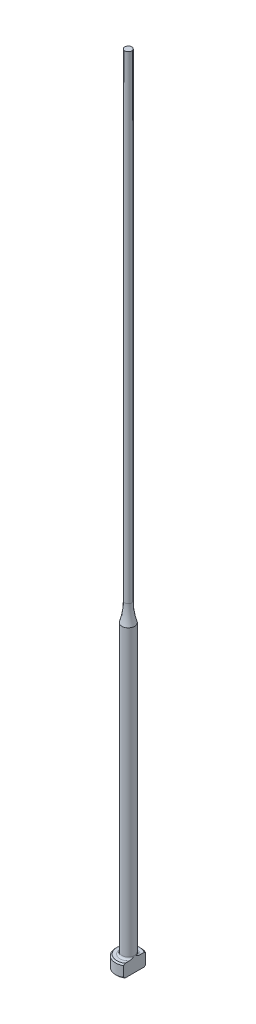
ISO-10303-21;
HEADER;
FILE_DESCRIPTION(('STEP AP214'),'2;1');
FILE_NAME('part.step','',(''),(''),'','','');
FILE_SCHEMA(('AUTOMOTIVE_DESIGN { 1 0 10303 214 1 1 1 1 }'));
ENDSEC;
DATA;
#1=APPLICATION_CONTEXT('core data for automotive mechanical design processes');
#2=APPLICATION_PROTOCOL_DEFINITION('international standard','automotive_design',2000,#1);
#3=PRODUCT_CONTEXT('',#1,'mechanical');
#4=PRODUCT('Part','Part','',(#3));
#5=PRODUCT_RELATED_PRODUCT_CATEGORY('part','',(#4));
#6=PRODUCT_DEFINITION_FORMATION('','',#4);
#7=PRODUCT_DEFINITION_CONTEXT('part definition',#1,'design');
#8=PRODUCT_DEFINITION('design','',#6,#7);
#9=PRODUCT_DEFINITION_SHAPE('','',#8);
#10=(LENGTH_UNIT() NAMED_UNIT(*) SI_UNIT(.MILLI.,.METRE.));
#11=(NAMED_UNIT(*) PLANE_ANGLE_UNIT() SI_UNIT($,.RADIAN.));
#12=(NAMED_UNIT(*) SI_UNIT($,.STERADIAN.) SOLID_ANGLE_UNIT());
#13=UNCERTAINTY_MEASURE_WITH_UNIT(LENGTH_MEASURE(1.E-05),#10,'distance_accuracy_value','');
#14=(GEOMETRIC_REPRESENTATION_CONTEXT(3) GLOBAL_UNCERTAINTY_ASSIGNED_CONTEXT((#13)) GLOBAL_UNIT_ASSIGNED_CONTEXT((#10,
#11,#12)) REPRESENTATION_CONTEXT('',''));
#15=CARTESIAN_POINT('',(0.,0.,0.));
#16=DIRECTION('',(0.,0.,1.));
#17=DIRECTION('',(1.,0.,0.));
#18=AXIS2_PLACEMENT_3D('',#15,#16,#17);
#19=CARTESIAN_POINT('',(-1.99999999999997,2.,0.));
#20=DIRECTION('',(0.,1.,0.));
#21=DIRECTION('',(0.,0.,1.));
#22=AXIS2_PLACEMENT_3D('',#19,#20,#21);
#23=PLANE('',#22);
#24=CARTESIAN_POINT('',(0.,2.,0.));
#25=DIRECTION('',(0.,1.,0.));
#26=DIRECTION('',(0.,0.,1.));
#27=AXIS2_PLACEMENT_3D('',#24,#25,#26);
#28=CIRCLE('',#27,1.79999999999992);
#29=CARTESIAN_POINT('',(0.999999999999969,2.,-1.4966629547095));
#30=VERTEX_POINT('',#29);
#31=CARTESIAN_POINT('',(0.999999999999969,2.,1.4966629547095));
#32=VERTEX_POINT('',#31);
#33=EDGE_CURVE('E187',#30,#32,#28,.T.);
#34=ORIENTED_EDGE('',*,*,#33,.T.);
#35=DIRECTION('',(0.,0.,-1.));
#36=VECTOR('',#35,1.);
#37=CARTESIAN_POINT('',(0.999999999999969,2.,0.));
#38=LINE('',#37,#36);
#39=CARTESIAN_POINT('',(0.999999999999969,2.00000000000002,0.830662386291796));
#40=VERTEX_POINT('',#39);
#41=EDGE_CURVE('E57',#32,#40,#38,.T.);
#42=ORIENTED_EDGE('',*,*,#41,.T.);
#43=CARTESIAN_POINT('',(0.,2.,0.));
#44=DIRECTION('',(0.,1.,0.));
#45=DIRECTION('',(0.,0.,1.));
#46=AXIS2_PLACEMENT_3D('',#43,#44,#45);
#47=CIRCLE('',#46,1.29999999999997);
#48=CARTESIAN_POINT('',(0.999999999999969,2.00000000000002,-0.830662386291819));
#49=VERTEX_POINT('',#48);
#50=EDGE_CURVE('E108',#40,#49,#47,.F.);
#51=ORIENTED_EDGE('',*,*,#50,.T.);
#52=EDGE_CURVE('E137',#49,#30,#38,.T.);
#53=ORIENTED_EDGE('',*,*,#52,.T.);
#54=EDGE_LOOP('',(#34,#42,#51,#53));
#55=FACE_BOUND('',#54,.T.);
#56=ADVANCED_FACE('F32',(#55),#23,.T.);
#57=CARTESIAN_POINT('',(0.,259.958771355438,0.));
#58=DIRECTION('',(0.,1.,0.));
#59=DIRECTION('',(0.,0.,1.));
#60=AXIS2_PLACEMENT_3D('',#57,#58,#59);
#61=CYLINDRICAL_SURFACE('',#60,1.99999999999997);
#62=CARTESIAN_POINT('',(0.,1.79999999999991,0.));
#63=DIRECTION('',(0.,1.,0.));
#64=DIRECTION('',(0.,0.,1.));
#65=AXIS2_PLACEMENT_3D('',#62,#63,#64);
#66=CIRCLE('',#65,1.99999999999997);
#67=CARTESIAN_POINT('',(0.999999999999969,1.79999999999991,1.73205080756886));
#68=VERTEX_POINT('',#67);
#69=CARTESIAN_POINT('',(0.999999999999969,1.79999999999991,-1.73205080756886));
#70=VERTEX_POINT('',#69);
#71=EDGE_CURVE('E105',#68,#70,#66,.F.);
#72=ORIENTED_EDGE('',*,*,#71,.T.);
#73=DIRECTION('',(0.,-1.,0.));
#74=VECTOR('',#73,1.);
#75=CARTESIAN_POINT('',(0.999999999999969,125.,-1.73205080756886));
#76=LINE('',#75,#74);
#77=CARTESIAN_POINT('',(0.999999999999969,0.199999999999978,-1.73205080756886));
#78=VERTEX_POINT('',#77);
#79=EDGE_CURVE('E193',#70,#78,#76,.T.);
#80=ORIENTED_EDGE('',*,*,#79,.T.);
#81=CARTESIAN_POINT('',(0.,0.199999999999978,0.));
#82=DIRECTION('',(0.,-1.,0.));
#83=DIRECTION('',(0.,0.,-1.));
#84=AXIS2_PLACEMENT_3D('',#81,#82,#83);
#85=CIRCLE('',#84,1.99999999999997);
#86=CARTESIAN_POINT('',(0.999999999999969,0.199999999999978,1.73205080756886));
#87=VERTEX_POINT('',#86);
#88=EDGE_CURVE('E100',#78,#87,#85,.F.);
#89=ORIENTED_EDGE('',*,*,#88,.T.);
#90=DIRECTION('',(0.,-1.,0.));
#91=VECTOR('',#90,1.);
#92=CARTESIAN_POINT('',(0.999999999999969,125.,1.73205080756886));
#93=LINE('',#92,#91);
#94=EDGE_CURVE('E93',#68,#87,#93,.T.);
#95=ORIENTED_EDGE('',*,*,#94,.F.);
#96=EDGE_LOOP('',(#72,#80,#89,#95));
#97=FACE_BOUND('',#96,.T.);
#98=ADVANCED_FACE('F158',(#97),#61,.T.);
#99=CARTESIAN_POINT('',(0.,0.,0.));
#100=DIRECTION('',(0.,-1.,0.));
#101=DIRECTION('',(0.,0.,-1.));
#102=AXIS2_PLACEMENT_3D('',#99,#100,#101);
#103=PLANE('',#102);
#104=CARTESIAN_POINT('',(0.,0.,0.));
#105=DIRECTION('',(0.,-1.,0.));
#106=DIRECTION('',(0.,0.,-1.));
#107=AXIS2_PLACEMENT_3D('',#104,#105,#106);
#108=CIRCLE('',#107,1.8);
#109=CARTESIAN_POINT('',(0.999999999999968,0.,1.49666295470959));
#110=VERTEX_POINT('',#109);
#111=CARTESIAN_POINT('',(0.999999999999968,0.,-1.49666295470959));
#112=VERTEX_POINT('',#111);
#113=EDGE_CURVE('E98',#110,#112,#108,.T.);
#114=ORIENTED_EDGE('',*,*,#113,.T.);
#115=DIRECTION('',(0.,0.,1.));
#116=VECTOR('',#115,1.);
#117=CARTESIAN_POINT('',(0.999999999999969,0.,-1.73205080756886));
#118=LINE('',#117,#116);
#119=EDGE_CURVE('E83',#112,#110,#118,.T.);
#120=ORIENTED_EDGE('',*,*,#119,.T.);
#121=EDGE_LOOP('',(#114,#120));
#122=FACE_BOUND('',#121,.T.);
#123=ADVANCED_FACE('F103',(#122),#103,.T.);
#124=CARTESIAN_POINT('',(0.,2.,0.));
#125=DIRECTION('',(0.,-1.,0.));
#126=DIRECTION('',(0.,0.,-1.));
#127=AXIS2_PLACEMENT_3D('',#124,#125,#126);
#128=CONICAL_SURFACE('',#127,1.79999999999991,0.785398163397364);
#129=ORIENTED_EDGE('',*,*,#71,.F.);
#130=CARTESIAN_POINT('',(0.999999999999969,-0.143084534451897,3.81417299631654));
#131=CARTESIAN_POINT('',(0.999999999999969,-0.0593997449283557,3.72765647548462));
#132=CARTESIAN_POINT('',(0.999999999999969,0.0241940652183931,3.64105173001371));
#133=CARTESIAN_POINT('',(0.999999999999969,0.19114891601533,3.46761616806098));
#134=CARTESIAN_POINT('',(0.999999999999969,0.27450995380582,3.38078534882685));
#135=CARTESIAN_POINT('',(0.999999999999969,0.52424932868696,3.11979400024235));
#136=CARTESIAN_POINT('',(0.999999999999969,0.690198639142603,2.94522254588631));
#137=CARTESIAN_POINT('',(0.999999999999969,1.0169755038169,2.59782670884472));
#138=CARTESIAN_POINT('',(0.999999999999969,1.1778392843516,2.42503661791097));
#139=CARTESIAN_POINT('',(0.999999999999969,1.41669118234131,2.16364984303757));
#140=CARTESIAN_POINT('',(0.999999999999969,1.49589273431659,2.07616357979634));
#141=CARTESIAN_POINT('',(0.999999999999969,1.653138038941,1.90015721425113));
#142=CARTESIAN_POINT('',(0.999999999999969,1.73118183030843,1.81163714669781));
#143=CARTESIAN_POINT('',(0.999999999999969,1.85567318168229,1.66767927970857));
#144=CARTESIAN_POINT('',(0.999999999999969,1.90265415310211,1.61270332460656));
#145=CARTESIAN_POINT('',(0.999999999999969,1.99577882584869,1.50203557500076));
#146=CARTESIAN_POINT('',(0.999999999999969,2.04192244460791,1.44634371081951));
#147=CARTESIAN_POINT('',(0.999999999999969,2.13356596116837,1.33345480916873));
#148=CARTESIAN_POINT('',(0.999999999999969,2.17905399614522,1.27624810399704));
#149=CARTESIAN_POINT('',(0.999999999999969,2.26844283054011,1.1606097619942));
#150=CARTESIAN_POINT('',(0.999999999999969,2.31234379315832,1.1021782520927));
#151=CARTESIAN_POINT('',(0.999999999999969,2.39853453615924,0.982773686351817));
#152=CARTESIAN_POINT('',(0.999999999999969,2.44078986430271,0.92177554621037));
#153=CARTESIAN_POINT('',(0.999999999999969,2.5218781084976,0.79738711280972));
#154=CARTESIAN_POINT('',(0.999999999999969,2.56070631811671,0.733993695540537));
#155=CARTESIAN_POINT('',(0.999999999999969,2.63248592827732,0.604932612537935));
#156=CARTESIAN_POINT('',(0.999999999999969,2.66550424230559,0.539302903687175));
#157=CARTESIAN_POINT('',(0.999999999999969,2.72301550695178,0.404437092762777));
#158=CARTESIAN_POINT('',(0.999999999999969,2.74753707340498,0.335214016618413));
#159=CARTESIAN_POINT('',(0.999999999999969,2.77407110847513,0.231400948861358));
#160=CARTESIAN_POINT('',(0.999999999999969,2.78110742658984,0.198093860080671));
#161=CARTESIAN_POINT('',(0.999999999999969,2.79200506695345,0.130954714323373));
#162=CARTESIAN_POINT('',(0.999999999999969,2.79586666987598,0.0971227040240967));
#163=CARTESIAN_POINT('',(0.999999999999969,2.80013905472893,0.0293410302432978));
#164=CARTESIAN_POINT('',(0.999999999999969,2.80056046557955,-0.00460794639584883));
#165=CARTESIAN_POINT('',(0.999999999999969,2.79795882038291,-0.0723663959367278));
#166=CARTESIAN_POINT('',(0.999999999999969,2.79493547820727,-0.106175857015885));
#167=CARTESIAN_POINT('',(0.999999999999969,2.78105481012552,-0.206326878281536));
#168=CARTESIAN_POINT('',(0.999999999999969,2.76542146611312,-0.272037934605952));
#169=CARTESIAN_POINT('',(0.999999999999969,2.73477554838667,-0.368312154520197));
#170=CARTESIAN_POINT('',(0.999999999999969,2.72331063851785,-0.400123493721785));
#171=CARTESIAN_POINT('',(0.999999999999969,2.69840546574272,-0.462964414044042));
#172=CARTESIAN_POINT('',(0.999999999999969,2.68496560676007,-0.493994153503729));
#173=CARTESIAN_POINT('',(0.999999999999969,2.64209309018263,-0.586298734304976));
#174=CARTESIAN_POINT('',(0.999999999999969,2.61022871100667,-0.64643570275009));
#175=CARTESIAN_POINT('',(0.999999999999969,2.54228534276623,-0.76430433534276));
#176=CARTESIAN_POINT('',(0.999999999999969,2.50620119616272,-0.822032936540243));
#177=CARTESIAN_POINT('',(0.999999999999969,2.43107084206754,-0.935840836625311));
#178=CARTESIAN_POINT('',(0.999999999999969,2.39201347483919,-0.991912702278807));
#179=CARTESIAN_POINT('',(0.999999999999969,2.31195870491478,-1.10259849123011));
#180=CARTESIAN_POINT('',(0.999999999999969,2.27096226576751,-1.15721311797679));
#181=CARTESIAN_POINT('',(0.999999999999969,2.18701695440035,-1.26606869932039));
#182=CARTESIAN_POINT('',(0.999999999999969,2.14404946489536,-1.32029522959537));
#183=CARTESIAN_POINT('',(0.999999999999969,2.05705050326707,-1.42788988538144));
#184=CARTESIAN_POINT('',(0.999999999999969,2.01301896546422,-1.48125795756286));
#185=CARTESIAN_POINT('',(0.999999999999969,1.8799506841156,-1.64010952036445));
#186=CARTESIAN_POINT('',(0.999999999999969,1.78973357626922,-1.74460261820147));
#187=CARTESIAN_POINT('',(0.999999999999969,1.62290341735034,-1.9342683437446));
#188=CARTESIAN_POINT('',(0.999999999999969,1.54658658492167,-2.01970404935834));
#189=CARTESIAN_POINT('',(0.999999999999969,1.39301250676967,-2.18973019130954));
#190=CARTESIAN_POINT('',(0.999999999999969,1.31575523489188,-2.27432060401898));
#191=CARTESIAN_POINT('',(0.999999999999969,1.08283440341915,-2.52732479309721));
#192=CARTESIAN_POINT('',(0.999999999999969,0.926165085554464,-2.69481086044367));
#193=CARTESIAN_POINT('',(0.999999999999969,0.617772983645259,-3.0214725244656));
#194=CARTESIAN_POINT('',(0.999999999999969,0.466111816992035,-3.18070657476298));
#195=CARTESIAN_POINT('',(0.999999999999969,0.238015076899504,-3.41880818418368));
#196=CARTESIAN_POINT('',(0.999999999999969,0.161924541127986,-3.49800657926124));
#197=CARTESIAN_POINT('',(0.999999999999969,0.00955322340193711,-3.65621892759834));
#198=CARTESIAN_POINT('',(0.999999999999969,-0.0667275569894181,-3.73523288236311));
#199=CARTESIAN_POINT('',(0.999999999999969,-0.143084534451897,-3.81417299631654));
#200=B_SPLINE_CURVE_WITH_KNOTS('',3,(#130,#131,#132,#133,#134,#135,#136,#137,#138,#139,#140,
#141,#142,#143,#144,#145,#146,#147,#148,#149,#150,#151,#152,#153,#154,#155,#156,#157,#158,#159,
#160,#161,#162,#163,#164,#165,#166,#167,#168,#169,#170,#171,#172,#173,#174,#175,#176,#177,#178,
#179,#180,#181,#182,#183,#184,#185,#186,#187,#188,#189,#190,#191,#192,#193,#194,#195,#196,#197,
#198,#199),.UNSPECIFIED.,.F.,.F.,(4,2,2,2,2,2,2,2,2,2,2,2,2,2,2,2,2,2,2,2,2,2,2,2,2,2,2,2,2,2,2,
2,2,2,4),(0.,0.361101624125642,0.722207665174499,1.44478731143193,2.15299784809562,
2.50702638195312,2.86104304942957,3.07798416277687,3.29494655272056,3.51418925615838,
3.73340935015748,3.95594813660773,4.17878792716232,4.3988639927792,4.6181915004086,
4.72018864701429,4.82217677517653,4.92384967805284,5.02553102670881,5.22698459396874,
5.32838854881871,5.4297717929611,5.63365200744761,5.83778406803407,6.04272417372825,
6.24756349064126,6.4551039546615,6.66265726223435,7.07676259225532,7.42043039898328,
7.76410778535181,8.45210822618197,9.11180822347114,9.44129145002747,9.77077197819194),.UNSPECIFIED.);
#201=EDGE_CURVE('E136',#68,#32,#200,.T.);
#202=ORIENTED_EDGE('',*,*,#201,.T.);
#203=ORIENTED_EDGE('',*,*,#33,.F.);
#204=EDGE_CURVE('E128',#30,#70,#200,.T.);
#205=ORIENTED_EDGE('',*,*,#204,.T.);
#206=EDGE_LOOP('',(#129,#202,#203,#205));
#207=FACE_BOUND('',#206,.T.);
#208=ADVANCED_FACE('F144',(#207),#128,.T.);
#209=CARTESIAN_POINT('',(0.,0.199999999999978,0.));
#210=DIRECTION('',(0.,1.,0.));
#211=DIRECTION('',(0.,0.,1.));
#212=AXIS2_PLACEMENT_3D('',#209,#210,#211);
#213=CONICAL_SURFACE('',#212,1.99999999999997,0.785398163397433);
#214=ORIENTED_EDGE('',*,*,#88,.F.);
#215=CARTESIAN_POINT('',(0.999999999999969,2.14308453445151,-3.81417299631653));
#216=CARTESIAN_POINT('',(0.999999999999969,2.05939974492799,-3.72765647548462));
#217=CARTESIAN_POINT('',(0.999999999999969,1.97580593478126,-3.64105173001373));
#218=CARTESIAN_POINT('',(0.999999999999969,1.80885108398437,-3.46761616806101));
#219=CARTESIAN_POINT('',(0.999999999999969,1.7254900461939,-3.38078534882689));
#220=CARTESIAN_POINT('',(0.999999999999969,1.47575067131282,-3.11979400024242));
#221=CARTESIAN_POINT('',(0.999999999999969,1.30980136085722,-2.94522254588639));
#222=CARTESIAN_POINT('',(0.999999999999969,0.983024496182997,-2.59782670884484));
#223=CARTESIAN_POINT('',(0.999999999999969,0.822160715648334,-2.42503661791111));
#224=CARTESIAN_POINT('',(0.999999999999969,0.583308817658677,-2.16364984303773));
#225=CARTESIAN_POINT('',(0.999999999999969,0.504107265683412,-2.07616357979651));
#226=CARTESIAN_POINT('',(0.999999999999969,0.34686196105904,-1.90015721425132));
#227=CARTESIAN_POINT('',(0.999999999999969,0.268818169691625,-1.81163714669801));
#228=CARTESIAN_POINT('',(0.999999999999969,0.144326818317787,-1.66767927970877));
#229=CARTESIAN_POINT('',(0.999999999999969,0.097345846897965,-1.61270332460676));
#230=CARTESIAN_POINT('',(0.999999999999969,0.00422117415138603,-1.50203557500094));
#231=CARTESIAN_POINT('',(0.999999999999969,-0.0419224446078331,-1.44634371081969));
#232=CARTESIAN_POINT('',(0.999999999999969,-0.133565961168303,-1.33345480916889));
#233=CARTESIAN_POINT('',(0.999999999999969,-0.179053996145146,-1.2762481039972));
#234=CARTESIAN_POINT('',(0.999999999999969,-0.268442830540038,-1.16060976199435));
#235=CARTESIAN_POINT('',(0.999999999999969,-0.312343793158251,-1.10217825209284));
#236=CARTESIAN_POINT('',(0.999999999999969,-0.398534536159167,-0.982773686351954));
#237=CARTESIAN_POINT('',(0.999999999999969,-0.440789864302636,-0.921775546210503));
#238=CARTESIAN_POINT('',(0.999999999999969,-0.521878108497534,-0.797387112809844));
#239=CARTESIAN_POINT('',(0.999999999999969,-0.560706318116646,-0.733993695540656));
#240=CARTESIAN_POINT('',(0.999999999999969,-0.632485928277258,-0.604932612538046));
#241=CARTESIAN_POINT('',(0.999999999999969,-0.665504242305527,-0.539302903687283));
#242=CARTESIAN_POINT('',(0.999999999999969,-0.723015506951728,-0.404437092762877));
#243=CARTESIAN_POINT('',(0.999999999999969,-0.747537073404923,-0.335214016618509));
#244=CARTESIAN_POINT('',(0.999999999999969,-0.774071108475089,-0.231400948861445));
#245=CARTESIAN_POINT('',(0.999999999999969,-0.781107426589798,-0.198093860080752));
#246=CARTESIAN_POINT('',(0.999999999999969,-0.792005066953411,-0.130954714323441));
#247=CARTESIAN_POINT('',(0.999999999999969,-0.795866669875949,-0.097122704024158));
#248=CARTESIAN_POINT('',(0.999999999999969,-0.800139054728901,-0.0293410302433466));
#249=CARTESIAN_POINT('',(0.999999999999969,-0.800560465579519,0.00460794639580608));
#250=CARTESIAN_POINT('',(0.999999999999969,-0.797958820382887,0.0723663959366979));
#251=CARTESIAN_POINT('',(0.999999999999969,-0.794935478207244,0.106175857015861));
#252=CARTESIAN_POINT('',(0.999999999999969,-0.78105481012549,0.206326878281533));
#253=CARTESIAN_POINT('',(0.999999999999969,-0.765421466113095,0.272037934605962));
#254=CARTESIAN_POINT('',(0.999999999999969,-0.734775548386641,0.368312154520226));
#255=CARTESIAN_POINT('',(0.999999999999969,-0.723310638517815,0.40012349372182));
#256=CARTESIAN_POINT('',(0.999999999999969,-0.698405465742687,0.46296441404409));
#257=CARTESIAN_POINT('',(0.999999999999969,-0.684965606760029,0.493994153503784));
#258=CARTESIAN_POINT('',(0.999999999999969,-0.642093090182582,0.586298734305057));
#259=CARTESIAN_POINT('',(0.999999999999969,-0.610228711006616,0.64643570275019));
#260=CARTESIAN_POINT('',(0.999999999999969,-0.542285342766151,0.764304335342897));
#261=CARTESIAN_POINT('',(0.999999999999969,-0.506201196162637,0.822032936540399));
#262=CARTESIAN_POINT('',(0.999999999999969,-0.431070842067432,0.935840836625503));
#263=CARTESIAN_POINT('',(0.999999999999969,-0.392013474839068,0.991912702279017));
#264=CARTESIAN_POINT('',(0.999999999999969,-0.311958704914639,1.10259849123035));
#265=CARTESIAN_POINT('',(0.999999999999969,-0.27096226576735,1.15721311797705));
#266=CARTESIAN_POINT('',(0.999999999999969,-0.187016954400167,1.26606869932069));
#267=CARTESIAN_POINT('',(0.999999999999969,-0.144049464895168,1.32029522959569));
#268=CARTESIAN_POINT('',(0.999999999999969,-0.0570505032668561,1.4278898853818));
#269=CARTESIAN_POINT('',(0.999999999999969,-0.0130189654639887,1.48125795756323));
#270=CARTESIAN_POINT('',(0.999999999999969,0.120049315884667,1.64010952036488));
#271=CARTESIAN_POINT('',(0.999999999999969,0.21026642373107,1.74460261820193));
#272=CARTESIAN_POINT('',(0.999999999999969,0.377096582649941,1.93426834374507));
#273=CARTESIAN_POINT('',(0.999999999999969,0.453413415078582,2.01970404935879));
#274=CARTESIAN_POINT('',(0.999999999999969,0.606987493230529,2.18973019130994));
#275=CARTESIAN_POINT('',(0.999999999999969,0.684244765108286,2.27432060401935));
#276=CARTESIAN_POINT('',(0.999999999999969,0.917165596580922,2.52732479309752));
#277=CARTESIAN_POINT('',(0.999999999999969,1.07383491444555,2.69481086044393));
#278=CARTESIAN_POINT('',(0.999999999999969,1.38222701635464,3.02147252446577));
#279=CARTESIAN_POINT('',(0.999999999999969,1.53388818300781,3.18070657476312));
#280=CARTESIAN_POINT('',(0.999999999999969,1.76198492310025,3.41880818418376));
#281=CARTESIAN_POINT('',(0.999999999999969,1.83807545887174,3.49800657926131));
#282=CARTESIAN_POINT('',(0.999999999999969,1.99044677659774,3.65621892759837));
#283=CARTESIAN_POINT('',(0.999999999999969,2.06672755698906,3.73523288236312));
#284=CARTESIAN_POINT('',(0.999999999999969,2.14308453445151,3.81417299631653));
#285=B_SPLINE_CURVE_WITH_KNOTS('',3,(#215,#216,#217,#218,#219,#220,#221,#222,#223,#224,#225,
#226,#227,#228,#229,#230,#231,#232,#233,#234,#235,#236,#237,#238,#239,#240,#241,#242,#243,#244,
#245,#246,#247,#248,#249,#250,#251,#252,#253,#254,#255,#256,#257,#258,#259,#260,#261,#262,#263,
#264,#265,#266,#267,#268,#269,#270,#271,#272,#273,#274,#275,#276,#277,#278,#279,#280,#281,#282,
#283,#284),.UNSPECIFIED.,.F.,.F.,(4,2,2,2,2,2,2,2,2,2,2,2,2,2,2,2,2,2,2,2,2,2,2,2,2,2,2,2,2,2,2,
2,2,2,4),(0.,0.36110162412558,0.722207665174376,1.44478731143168,2.15299784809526,
2.5070263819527,2.8610430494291,3.07798416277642,3.29494655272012,3.51418925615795,
3.73340935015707,3.95594813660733,4.17878792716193,4.39886399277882,4.61819150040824,
4.72018864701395,4.82217677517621,4.92384967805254,5.02553102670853,5.22698459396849,
5.32838854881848,5.42977179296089,5.63365200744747,5.83778406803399,6.04272417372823,
6.24756349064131,6.45510395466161,6.66265726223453,7.07676259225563,7.42043039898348,
7.7641077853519,8.45210822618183,9.1118082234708,9.44129145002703,9.77077197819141),.UNSPECIFIED.);
#286=EDGE_CURVE('E86',#78,#112,#285,.T.);
#287=ORIENTED_EDGE('',*,*,#286,.T.);
#288=ORIENTED_EDGE('',*,*,#113,.F.);
#289=EDGE_CURVE('E89',#110,#87,#285,.T.);
#290=ORIENTED_EDGE('',*,*,#289,.T.);
#291=EDGE_LOOP('',(#214,#287,#288,#290));
#292=FACE_BOUND('',#291,.T.);
#293=ADVANCED_FACE('F97',(#292),#213,.T.);
#294=CARTESIAN_POINT('',(0.,2.30000000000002,0.));
#295=DIRECTION('',(0.,1.,0.));
#296=DIRECTION('',(0.,0.,1.));
#297=AXIS2_PLACEMENT_3D('',#294,#295,#296);
#298=TOROIDAL_SURFACE('',#297,1.29999999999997,0.3);
#299=CARTESIAN_POINT('',(0.999999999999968,2.30000000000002,0.));
#300=CARTESIAN_POINT('',(0.999999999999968,2.30000064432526,8.6574445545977E-12));
#301=CARTESIAN_POINT('',(0.999999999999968,2.30000128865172,-9.05742231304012E-08));
#302=CARTESIAN_POINT('',(0.999999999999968,2.30000254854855,-3.98319620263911E-07));
#303=CARTESIAN_POINT('',(0.999999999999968,2.30000316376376,-6.16748313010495E-07));
#304=CARTESIAN_POINT('',(0.999999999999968,2.30000438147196,-1.15047367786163E-06));
#305=CARTESIAN_POINT('',(0.999999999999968,2.30000498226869,-1.46954564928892E-06));
#306=CARTESIAN_POINT('',(0.999999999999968,2.30000613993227,-2.17388585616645E-06));
#307=CARTESIAN_POINT('',(0.999999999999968,2.3000066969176,-2.55896592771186E-06));
#308=CARTESIAN_POINT('',(0.999999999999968,2.30000847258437,-3.89137454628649E-06));
#309=CARTESIAN_POINT('',(0.999999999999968,2.30000962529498,-4.9272569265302E-06));
#310=CARTESIAN_POINT('',(0.999999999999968,2.30001175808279,-7.12255376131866E-06));
#311=CARTESIAN_POINT('',(0.999999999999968,2.30001274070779,-8.27963246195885E-06));
#312=CARTESIAN_POINT('',(0.999999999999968,2.30001619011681,-1.25710396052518E-05));
#313=CARTESIAN_POINT('',(0.999999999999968,2.30001847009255,-1.58589994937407E-05));
#314=CARTESIAN_POINT('',(0.999999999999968,2.3000224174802,-2.25210462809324E-05));
#315=CARTESIAN_POINT('',(0.999999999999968,2.30002411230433,-2.58796667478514E-05));
#316=CARTESIAN_POINT('',(0.999999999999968,2.30003085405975,-3.94941957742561E-05));
#317=CARTESIAN_POINT('',(0.999999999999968,2.30003568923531,-4.98493079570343E-05));
#318=CARTESIAN_POINT('',(0.999999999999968,2.30004388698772,-6.96407730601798E-05));
#319=CARTESIAN_POINT('',(0.999999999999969,2.30004735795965,-7.903098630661E-05));
#320=CARTESIAN_POINT('',(0.999999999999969,2.30007348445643,-0.000144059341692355));
#321=CARTESIAN_POINT('',(0.999999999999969,2.30010510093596,-0.000195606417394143));
#322=CARTESIAN_POINT('',(0.999999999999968,2.30022061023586,-0.000391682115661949));
#323=CARTESIAN_POINT('',(0.999999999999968,2.3002978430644,-0.000539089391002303));
#324=CARTESIAN_POINT('',(0.999999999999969,2.30059433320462,-0.00109591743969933));
#325=CARTESIAN_POINT('',(0.999999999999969,2.30082052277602,-0.00150237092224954));
#326=CARTESIAN_POINT('',(0.999999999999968,2.30171558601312,-0.00311941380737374));
#327=CARTESIAN_POINT('',(0.999999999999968,2.30237677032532,-0.00433326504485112));
#328=CARTESIAN_POINT('',(0.999999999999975,2.31602135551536,-0.0293725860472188));
#329=CARTESIAN_POINT('',(0.99999999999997,2.32909104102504,-0.0531623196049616));
#330=CARTESIAN_POINT('',(0.999999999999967,2.35458080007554,-0.100088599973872));
#331=CARTESIAN_POINT('',(0.999999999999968,2.36700820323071,-0.123221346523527));
#332=CARTESIAN_POINT('',(0.999999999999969,2.39281545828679,-0.172044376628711));
#333=CARTESIAN_POINT('',(0.999999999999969,2.4061616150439,-0.197752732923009));
#334=CARTESIAN_POINT('',(0.999999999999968,2.4323541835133,-0.249714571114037));
#335=CARTESIAN_POINT('',(0.999999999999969,2.44519503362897,-0.27597087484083));
#336=CARTESIAN_POINT('',(0.999999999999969,2.46718175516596,-0.322864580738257));
#337=CARTESIAN_POINT('',(0.999999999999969,2.47650292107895,-0.34341923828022));
#338=CARTESIAN_POINT('',(0.999999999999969,2.49448113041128,-0.384761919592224));
#339=CARTESIAN_POINT('',(0.999999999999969,2.50313958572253,-0.405549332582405));
#340=CARTESIAN_POINT('',(0.999999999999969,2.5276434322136,-0.467585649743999));
#341=CARTESIAN_POINT('',(0.999999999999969,2.54239224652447,-0.509286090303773));
#342=CARTESIAN_POINT('',(0.999999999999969,2.56458900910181,-0.58349816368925));
#343=CARTESIAN_POINT('',(0.999999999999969,2.57294045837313,-0.61573699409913));
#344=CARTESIAN_POINT('',(0.999999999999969,2.58691787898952,-0.682155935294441));
#345=CARTESIAN_POINT('',(0.999999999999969,2.5924232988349,-0.716362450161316));
#346=CARTESIAN_POINT('',(0.999999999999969,2.59932200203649,-0.784996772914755));
#347=CARTESIAN_POINT('',(0.999999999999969,2.60074119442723,-0.819421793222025));
#348=CARTESIAN_POINT('',(0.999999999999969,2.59853032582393,-0.88779225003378));
#349=CARTESIAN_POINT('',(0.999999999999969,2.59495737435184,-0.921738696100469));
#350=CARTESIAN_POINT('',(0.999999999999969,2.58381038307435,-0.977927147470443));
#351=CARTESIAN_POINT('',(0.999999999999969,2.57785171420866,-1.00048693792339));
#352=CARTESIAN_POINT('',(0.999999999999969,2.56267132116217,-1.0445512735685));
#353=CARTESIAN_POINT('',(0.999999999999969,2.55344592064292,-1.06605459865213));
#354=CARTESIAN_POINT('',(0.999999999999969,2.53348156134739,-1.10327564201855));
#355=CARTESIAN_POINT('',(0.999999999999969,2.52335553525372,-1.11931996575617));
#356=CARTESIAN_POINT('',(0.999999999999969,2.50063930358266,-1.1495565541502));
#357=CARTESIAN_POINT('',(0.999999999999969,2.48805327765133,-1.16375189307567));
#358=CARTESIAN_POINT('',(0.999999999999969,2.46313284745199,-1.18709127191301));
#359=CARTESIAN_POINT('',(0.999999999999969,2.45121755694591,-1.19668155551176));
#360=CARTESIAN_POINT('',(0.999999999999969,2.4259612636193,-1.21377371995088));
#361=CARTESIAN_POINT('',(0.999999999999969,2.41262072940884,-1.2212762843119));
#362=CARTESIAN_POINT('',(0.999999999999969,2.38471163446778,-1.23381879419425));
#363=CARTESIAN_POINT('',(0.999999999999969,2.3701356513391,-1.23884240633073));
#364=CARTESIAN_POINT('',(0.999999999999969,2.34029120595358,-1.2460136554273));
#365=CARTESIAN_POINT('',(0.999999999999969,2.32502317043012,-1.24816304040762));
#366=CARTESIAN_POINT('',(0.999999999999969,2.29609418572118,-1.24936303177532));
#367=CARTESIAN_POINT('',(0.999999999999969,2.28244572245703,-1.24873511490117));
#368=CARTESIAN_POINT('',(0.999999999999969,2.25546467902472,-1.24513625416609));
#369=CARTESIAN_POINT('',(0.999999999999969,2.2421320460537,-1.24216570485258));
#370=CARTESIAN_POINT('',(0.999999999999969,2.21644742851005,-1.23414136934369));
#371=CARTESIAN_POINT('',(0.999999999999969,2.20408009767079,-1.22913614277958));
#372=CARTESIAN_POINT('',(0.999999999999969,2.18026539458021,-1.2172891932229));
#373=CARTESIAN_POINT('',(0.999999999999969,2.16881815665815,-1.21044720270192));
#374=CARTESIAN_POINT('',(0.999999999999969,2.14602713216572,-1.19450929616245));
#375=CARTESIAN_POINT('',(0.999999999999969,2.1347876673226,-1.18526487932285));
#376=CARTESIAN_POINT('',(0.999999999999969,2.11372805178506,-1.16528066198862));
#377=CARTESIAN_POINT('',(0.999999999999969,2.1039092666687,-1.15453944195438));
#378=CARTESIAN_POINT('',(0.999999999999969,2.08131380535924,-1.12639326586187));
#379=CARTESIAN_POINT('',(0.999999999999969,2.06941227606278,-1.10828305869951));
#380=CARTESIAN_POINT('',(0.999999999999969,2.04871157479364,-1.07041295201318));
#381=CARTESIAN_POINT('',(0.999999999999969,2.03991325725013,-1.05065259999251));
#382=CARTESIAN_POINT('',(0.999999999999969,2.02219264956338,-1.00203188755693));
#383=CARTESIAN_POINT('',(0.999999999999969,2.01461756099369,-0.972682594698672));
#384=CARTESIAN_POINT('',(0.999999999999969,2.00410660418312,-0.912914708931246));
#385=CARTESIAN_POINT('',(0.999999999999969,2.00122174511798,-0.882487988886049));
#386=CARTESIAN_POINT('',(0.999999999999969,1.99886242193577,-0.80318909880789));
#387=CARTESIAN_POINT('',(0.999999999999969,2.0024814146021,-0.754226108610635));
#388=CARTESIAN_POINT('',(0.999999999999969,2.01327071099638,-0.682724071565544));
#389=CARTESIAN_POINT('',(0.999999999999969,2.01762186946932,-0.659663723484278));
#390=CARTESIAN_POINT('',(0.999999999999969,2.02775671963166,-0.613959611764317));
#391=CARTESIAN_POINT('',(0.999999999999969,2.03353398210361,-0.59131445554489));
#392=CARTESIAN_POINT('',(0.999999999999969,2.05232003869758,-0.525222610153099));
#393=CARTESIAN_POINT('',(0.999999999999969,2.0670175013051,-0.482256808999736));
#394=CARTESIAN_POINT('',(0.999999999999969,2.09166172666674,-0.418361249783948));
#395=CARTESIAN_POINT('',(0.999999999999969,2.10040936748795,-0.396945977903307));
#396=CARTESIAN_POINT('',(0.999999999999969,2.11862724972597,-0.354367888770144));
#397=CARTESIAN_POINT('',(0.999999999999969,2.12809902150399,-0.33320572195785));
#398=CARTESIAN_POINT('',(0.999999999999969,2.15054796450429,-0.284809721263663));
#399=CARTESIAN_POINT('',(0.999999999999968,2.16372144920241,-0.257667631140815));
#400=CARTESIAN_POINT('',(0.999999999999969,2.19063957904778,-0.203972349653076));
#401=CARTESIAN_POINT('',(0.999999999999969,2.20437810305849,-0.177416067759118));
#402=CARTESIAN_POINT('',(0.999999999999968,2.23096755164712,-0.127000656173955));
#403=CARTESIAN_POINT('',(0.999999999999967,2.2437812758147,-0.103121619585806));
#404=CARTESIAN_POINT('',(0.99999999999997,2.27007504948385,-0.0546869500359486));
#405=CARTESIAN_POINT('',(0.999999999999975,2.28356304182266,-0.0301354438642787));
#406=CARTESIAN_POINT('',(0.999999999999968,2.29762327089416,-0.00433318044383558));
#407=CARTESIAN_POINT('',(0.999999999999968,2.29828450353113,-0.00311924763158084));
#408=CARTESIAN_POINT('',(0.999999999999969,2.29917957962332,-0.0015021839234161));
#409=CARTESIAN_POINT('',(0.999999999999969,2.2994057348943,-0.0010957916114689));
#410=CARTESIAN_POINT('',(0.999999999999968,2.29970218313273,-0.000539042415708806));
#411=CARTESIAN_POINT('',(0.999999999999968,2.29977940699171,-0.000391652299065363));
#412=CARTESIAN_POINT('',(0.999999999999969,2.29989490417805,-0.000195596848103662));
#413=CARTESIAN_POINT('',(0.999999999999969,2.2999265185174,-0.000144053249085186));
#414=CARTESIAN_POINT('',(0.999999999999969,2.29995264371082,-7.90290824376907E-05));
#415=CARTESIAN_POINT('',(0.999999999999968,2.29995611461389,-6.96391975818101E-05));
#416=CARTESIAN_POINT('',(0.999999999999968,2.29996431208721,-4.98484228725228E-05));
#417=CARTESIAN_POINT('',(0.999999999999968,2.29996914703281,-3.94936645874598E-05));
#418=CARTESIAN_POINT('',(0.999999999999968,2.29997588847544,-2.587953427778E-05));
#419=CARTESIAN_POINT('',(0.999999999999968,2.29997758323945,-2.25209724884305E-05));
#420=CARTESIAN_POINT('',(0.999999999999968,2.29998153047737,-1.58590310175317E-05));
#421=CARTESIAN_POINT('',(0.999999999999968,2.29998381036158,-1.25711163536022E-05));
#422=CARTESIAN_POINT('',(0.999999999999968,2.29998725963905,-8.27974911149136E-06));
#423=CARTESIAN_POINT('',(0.999999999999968,2.29998824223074,-7.122675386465E-06));
#424=CARTESIAN_POINT('',(0.999999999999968,2.29999037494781,-4.92738159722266E-06));
#425=CARTESIAN_POINT('',(0.999999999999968,2.29999152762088,-3.89149712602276E-06));
#426=CARTESIAN_POINT('',(0.999999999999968,2.29999330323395,-2.5590774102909E-06));
#427=CARTESIAN_POINT('',(0.999999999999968,2.29999386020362,-2.17399250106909E-06));
#428=CARTESIAN_POINT('',(0.999999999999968,2.29999501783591,-1.4696398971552E-06));
#429=CARTESIAN_POINT('',(0.999999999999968,2.299995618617,-1.15056035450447E-06));
#430=CARTESIAN_POINT('',(0.999999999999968,2.29999683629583,-6.16816558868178E-07));
#431=CARTESIAN_POINT('',(0.999999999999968,2.29999745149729,-3.98377208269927E-07));
#432=CARTESIAN_POINT('',(0.999999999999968,2.29999871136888,-9.06063088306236E-08));
#433=CARTESIAN_POINT('',(0.999999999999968,2.29999935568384,-8.657323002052E-12));
#434=CARTESIAN_POINT('',(0.999999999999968,2.30000000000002,0.));
#435=B_SPLINE_CURVE_WITH_KNOTS('',3,(#299,#300,#301,#302,#303,#304,#305,#306,#307,#308,#309,
#310,#311,#312,#313,#314,#315,#316,#317,#318,#319,#320,#321,#322,#323,#324,#325,#326,#327,#328,
#329,#330,#331,#332,#333,#334,#335,#336,#337,#338,#339,#340,#341,#342,#343,#344,#345,#346,#347,
#348,#349,#350,#351,#352,#353,#354,#355,#356,#357,#358,#359,#360,#361,#362,#363,#364,#365,#366,
#367,#368,#369,#370,#371,#372,#373,#374,#375,#376,#377,#378,#379,#380,#381,#382,#383,#384,#385,
#386,#387,#388,#389,#390,#391,#392,#393,#394,#395,#396,#397,#398,#399,#400,#401,#402,#403,#404,
#405,#406,#407,#408,#409,#410,#411,#412,#413,#414,#415,#416,#417,#418,#419,#420,#421,#422,#423,
#424,#425,#426,#427,#428,#429,#430,#431,#432,#433,#434),.UNSPECIFIED.,.T.,.F.,(4,2,2,2,2,2,2,2,
2,2,2,2,2,2,2,2,2,2,2,2,2,2,2,2,2,2,2,2,2,2,2,2,2,2,2,2,2,2,2,2,2,2,2,2,2,2,2,2,2,2,2,2,2,2,2,2,
2,2,2,2,2,2,2,2,2,2,2,4),(0.,1.93088000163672E-06,3.88121487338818E-06,5.91576027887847E-06,
7.94459959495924E-06,1.25713540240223E-05,1.71213138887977E-05,2.9075120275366E-05,
4.0350817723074E-05,7.46190414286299E-05,0.000104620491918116,0.00028499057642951,
0.000785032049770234,0.00217951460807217,0.00632720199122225,0.0877445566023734,
0.166524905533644,0.253417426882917,0.341089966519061,0.408787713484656,0.476336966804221,
0.608850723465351,0.708652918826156,0.812393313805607,0.915474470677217,1.01738599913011,
1.08718721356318,1.15706723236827,1.21377727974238,1.27039179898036,1.31609373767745,
1.36178069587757,1.40776478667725,1.4537208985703,1.49450576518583,1.5352837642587,
1.57514089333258,1.61500383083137,1.65849635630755,1.70203041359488,1.76667915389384,
1.83134568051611,1.92177629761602,2.0131839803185,2.15955153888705,2.22993031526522,
2.29999742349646,2.43600819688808,2.50540041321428,2.57494356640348,2.66544006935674,
2.75513178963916,2.83643278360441,2.92045687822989,2.92460484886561,2.92599912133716,
2.926499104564,2.92667946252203,2.92670946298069,2.92674372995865,2.92675500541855,
2.92676695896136,2.92677150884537,2.92677613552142,2.92677816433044,2.92678019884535,
2.92678214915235,2.92678408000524),.UNSPECIFIED.);
#436=CARTESIAN_POINT('',(0.999999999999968,2.30000000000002,0.));
#437=VERTEX_POINT('',#436);
#438=EDGE_CURVE('E11',#49,#437,#435,.T.);
#439=ORIENTED_EDGE('',*,*,#438,.F.);
#440=ORIENTED_EDGE('',*,*,#50,.F.);
#441=CARTESIAN_POINT('',(0.999999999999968,2.30000000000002,0.));
#442=CARTESIAN_POINT('',(0.999999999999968,2.29999935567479,-8.65741696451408E-12));
#443=CARTESIAN_POINT('',(0.999999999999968,2.29999871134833,9.05742231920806E-08));
#444=CARTESIAN_POINT('',(0.999999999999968,2.2999974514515,3.98319620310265E-07));
#445=CARTESIAN_POINT('',(0.999999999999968,2.29999683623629,6.16748313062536E-07));
#446=CARTESIAN_POINT('',(0.999999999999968,2.29999561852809,1.15047367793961E-06));
#447=CARTESIAN_POINT('',(0.999999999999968,2.29999501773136,1.46954564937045E-06));
#448=CARTESIAN_POINT('',(0.999999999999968,2.29999386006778,2.17388585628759E-06));
#449=CARTESIAN_POINT('',(0.999999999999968,2.29999330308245,2.55896592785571E-06));
#450=CARTESIAN_POINT('',(0.999999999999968,2.29999152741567,3.89137454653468E-06));
#451=CARTESIAN_POINT('',(0.999999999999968,2.29999037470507,4.92725692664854E-06));
#452=CARTESIAN_POINT('',(0.999999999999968,2.29998824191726,7.12255376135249E-06));
#453=CARTESIAN_POINT('',(0.999999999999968,2.29998725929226,8.27963246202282E-06));
#454=CARTESIAN_POINT('',(0.999999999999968,2.29998380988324,1.25710396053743E-05));
#455=CARTESIAN_POINT('',(0.999999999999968,2.2999815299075,1.58589994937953E-05));
#456=CARTESIAN_POINT('',(0.999999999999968,2.29997758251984,2.25210462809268E-05));
#457=CARTESIAN_POINT('',(0.999999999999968,2.29997588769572,2.58796667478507E-05));
#458=CARTESIAN_POINT('',(0.999999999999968,2.29996914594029,3.94941957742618E-05));
#459=CARTESIAN_POINT('',(0.999999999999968,2.29996431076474,4.98493079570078E-05));
#460=CARTESIAN_POINT('',(0.999999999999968,2.29995611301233,6.96407730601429E-05));
#461=CARTESIAN_POINT('',(0.999999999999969,2.2999526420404,7.90309863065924E-05));
#462=CARTESIAN_POINT('',(0.999999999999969,2.29992651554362,0.000144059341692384));
#463=CARTESIAN_POINT('',(0.999999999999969,2.29989489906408,0.000195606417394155));
#464=CARTESIAN_POINT('',(0.999999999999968,2.29977938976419,0.000391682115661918));
#465=CARTESIAN_POINT('',(0.999999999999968,2.29970215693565,0.000539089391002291));
#466=CARTESIAN_POINT('',(0.999999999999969,2.29940566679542,0.00109591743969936));
#467=CARTESIAN_POINT('',(0.999999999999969,2.29917947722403,0.00150237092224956));
#468=CARTESIAN_POINT('',(0.999999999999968,2.29828441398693,0.0031194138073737));
#469=CARTESIAN_POINT('',(0.999999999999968,2.29762322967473,0.0043332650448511));
#470=CARTESIAN_POINT('',(0.999999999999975,2.28397864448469,0.0293725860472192));
#471=CARTESIAN_POINT('',(0.99999999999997,2.27090895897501,0.0531623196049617));
#472=CARTESIAN_POINT('',(0.999999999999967,2.24541919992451,0.100088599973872));
#473=CARTESIAN_POINT('',(0.999999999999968,2.23299179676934,0.123221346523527));
#474=CARTESIAN_POINT('',(0.999999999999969,2.20718454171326,0.172044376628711));
#475=CARTESIAN_POINT('',(0.999999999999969,2.19383838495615,0.197752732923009));
#476=CARTESIAN_POINT('',(0.999999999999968,2.16764581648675,0.249714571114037));
#477=CARTESIAN_POINT('',(0.999999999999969,2.15480496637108,0.27597087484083));
#478=CARTESIAN_POINT('',(0.999999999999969,2.13281824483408,0.322864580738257));
#479=CARTESIAN_POINT('',(0.999999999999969,2.1234970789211,0.34341923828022));
#480=CARTESIAN_POINT('',(0.999999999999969,2.10551886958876,0.384761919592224));
#481=CARTESIAN_POINT('',(0.999999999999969,2.09686041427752,0.405549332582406));
#482=CARTESIAN_POINT('',(0.999999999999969,2.07235656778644,0.467585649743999));
#483=CARTESIAN_POINT('',(0.999999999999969,2.05760775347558,0.509286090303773));
#484=CARTESIAN_POINT('',(0.999999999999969,2.03541099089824,0.58349816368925));
#485=CARTESIAN_POINT('',(0.999999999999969,2.02705954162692,0.61573699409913));
#486=CARTESIAN_POINT('',(0.999999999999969,2.01308212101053,0.682155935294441));
#487=CARTESIAN_POINT('',(0.999999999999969,2.00757670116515,0.716362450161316));
#488=CARTESIAN_POINT('',(0.999999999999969,2.00067799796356,0.784996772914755));
#489=CARTESIAN_POINT('',(0.999999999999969,1.99925880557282,0.819421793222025));
#490=CARTESIAN_POINT('',(0.999999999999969,2.00146967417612,0.88779225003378));
#491=CARTESIAN_POINT('',(0.999999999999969,2.00504262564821,0.921738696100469));
#492=CARTESIAN_POINT('',(0.999999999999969,2.0161896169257,0.977927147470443));
#493=CARTESIAN_POINT('',(0.999999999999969,2.02214828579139,1.00048693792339));
#494=CARTESIAN_POINT('',(0.999999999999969,2.03732867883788,1.0445512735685));
#495=CARTESIAN_POINT('',(0.999999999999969,2.04655407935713,1.06605459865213));
#496=CARTESIAN_POINT('',(0.999999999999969,2.06651843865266,1.10327564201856));
#497=CARTESIAN_POINT('',(0.999999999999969,2.07664446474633,1.11931996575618));
#498=CARTESIAN_POINT('',(0.999999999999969,2.09936069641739,1.14955655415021));
#499=CARTESIAN_POINT('',(0.999999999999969,2.11194672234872,1.16375189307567));
#500=CARTESIAN_POINT('',(0.999999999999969,2.13686715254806,1.18709127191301));
#501=CARTESIAN_POINT('',(0.999999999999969,2.14878244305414,1.19668155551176));
#502=CARTESIAN_POINT('',(0.999999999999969,2.17403873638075,1.21377371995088));
#503=CARTESIAN_POINT('',(0.999999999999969,2.18737927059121,1.2212762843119));
#504=CARTESIAN_POINT('',(0.999999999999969,2.21528836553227,1.23381879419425));
#505=CARTESIAN_POINT('',(0.999999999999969,2.22986434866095,1.23884240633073));
#506=CARTESIAN_POINT('',(0.999999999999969,2.25970879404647,1.2460136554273));
#507=CARTESIAN_POINT('',(0.999999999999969,2.27497682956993,1.24816304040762));
#508=CARTESIAN_POINT('',(0.999999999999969,2.30390581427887,1.24936303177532));
#509=CARTESIAN_POINT('',(0.999999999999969,2.31755427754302,1.24873511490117));
#510=CARTESIAN_POINT('',(0.999999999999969,2.34453532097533,1.24513625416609));
#511=CARTESIAN_POINT('',(0.999999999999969,2.35786795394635,1.24216570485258));
#512=CARTESIAN_POINT('',(0.999999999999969,2.38355257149,1.23414136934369));
#513=CARTESIAN_POINT('',(0.999999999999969,2.39591990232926,1.22913614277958));
#514=CARTESIAN_POINT('',(0.999999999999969,2.41973460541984,1.2172891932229));
#515=CARTESIAN_POINT('',(0.999999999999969,2.4311818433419,1.21044720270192));
#516=CARTESIAN_POINT('',(0.999999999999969,2.45397286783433,1.19450929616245));
#517=CARTESIAN_POINT('',(0.999999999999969,2.46521233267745,1.18526487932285));
#518=CARTESIAN_POINT('',(0.999999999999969,2.48627194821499,1.16528066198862));
#519=CARTESIAN_POINT('',(0.999999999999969,2.49609073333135,1.15453944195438));
#520=CARTESIAN_POINT('',(0.999999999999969,2.51868619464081,1.12639326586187));
#521=CARTESIAN_POINT('',(0.999999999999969,2.53058772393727,1.10828305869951));
#522=CARTESIAN_POINT('',(0.999999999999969,2.55128842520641,1.07041295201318));
#523=CARTESIAN_POINT('',(0.999999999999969,2.56008674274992,1.05065259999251));
#524=CARTESIAN_POINT('',(0.999999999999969,2.57780735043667,1.00203188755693));
#525=CARTESIAN_POINT('',(0.999999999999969,2.58538243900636,0.972682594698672));
#526=CARTESIAN_POINT('',(0.999999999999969,2.59589339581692,0.912914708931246));
#527=CARTESIAN_POINT('',(0.999999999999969,2.59877825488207,0.882487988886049));
#528=CARTESIAN_POINT('',(0.999999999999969,2.60113757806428,0.80318909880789));
#529=CARTESIAN_POINT('',(0.999999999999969,2.59751858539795,0.754226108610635));
#530=CARTESIAN_POINT('',(0.999999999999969,2.58672928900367,0.682724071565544));
#531=CARTESIAN_POINT('',(0.999999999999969,2.58237813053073,0.659663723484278));
#532=CARTESIAN_POINT('',(0.999999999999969,2.57224328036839,0.613959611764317));
#533=CARTESIAN_POINT('',(0.999999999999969,2.56646601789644,0.59131445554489));
#534=CARTESIAN_POINT('',(0.999999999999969,2.54767996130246,0.525222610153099));
#535=CARTESIAN_POINT('',(0.999999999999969,2.53298249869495,0.482256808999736));
#536=CARTESIAN_POINT('',(0.999999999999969,2.50833827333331,0.418361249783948));
#537=CARTESIAN_POINT('',(0.999999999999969,2.49959063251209,0.396945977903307));
#538=CARTESIAN_POINT('',(0.999999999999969,2.48137275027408,0.354367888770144));
#539=CARTESIAN_POINT('',(0.999999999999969,2.47190097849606,0.33320572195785));
#540=CARTESIAN_POINT('',(0.999999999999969,2.44945203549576,0.284809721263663));
#541=CARTESIAN_POINT('',(0.999999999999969,2.43627855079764,0.257667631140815));
#542=CARTESIAN_POINT('',(0.999999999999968,2.40936042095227,0.203972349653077));
#543=CARTESIAN_POINT('',(0.999999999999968,2.39562189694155,0.177416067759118));
#544=CARTESIAN_POINT('',(0.999999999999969,2.36903244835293,0.127000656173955));
#545=CARTESIAN_POINT('',(0.999999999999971,2.35621872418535,0.103121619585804));
#546=CARTESIAN_POINT('',(0.999999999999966,2.32992495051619,0.0546869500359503));
#547=CARTESIAN_POINT('',(0.999999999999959,2.31643695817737,0.0301354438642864));
#548=CARTESIAN_POINT('',(0.999999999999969,2.30237672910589,0.0043331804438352));
#549=CARTESIAN_POINT('',(0.99999999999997,2.30171549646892,0.00311924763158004));
#550=CARTESIAN_POINT('',(0.999999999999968,2.30082042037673,0.00150218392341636));
#551=CARTESIAN_POINT('',(0.999999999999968,2.30059426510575,0.00109579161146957));
#552=CARTESIAN_POINT('',(0.999999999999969,2.30029781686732,0.000539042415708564));
#553=CARTESIAN_POINT('',(0.999999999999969,2.30022059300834,0.000391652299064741));
#554=CARTESIAN_POINT('',(0.999999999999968,2.300105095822,0.000195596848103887));
#555=CARTESIAN_POINT('',(0.999999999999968,2.30007348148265,0.000144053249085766));
#556=CARTESIAN_POINT('',(0.999999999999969,2.30004735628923,7.90290824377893E-05));
#557=CARTESIAN_POINT('',(0.999999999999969,2.30004388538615,6.96391975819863E-05));
#558=CARTESIAN_POINT('',(0.999999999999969,2.30003568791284,4.98484228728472E-05));
#559=CARTESIAN_POINT('',(0.999999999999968,2.30003085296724,3.9493664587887E-05));
#560=CARTESIAN_POINT('',(0.999999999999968,2.30002411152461,2.5879534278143E-05));
#561=CARTESIAN_POINT('',(0.999999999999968,2.3000224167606,2.25209724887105E-05));
#562=CARTESIAN_POINT('',(0.999999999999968,2.30001846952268,1.58590310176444E-05));
#563=CARTESIAN_POINT('',(0.999999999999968,2.30001618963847,1.25711163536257E-05));
#564=CARTESIAN_POINT('',(0.999999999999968,2.300012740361,8.27974911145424E-06));
#565=CARTESIAN_POINT('',(0.999999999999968,2.30001175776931,7.12267538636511E-06));
#566=CARTESIAN_POINT('',(0.999999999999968,2.30000962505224,4.92738159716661E-06));
#567=CARTESIAN_POINT('',(0.999999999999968,2.30000847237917,3.89149712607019E-06));
#568=CARTESIAN_POINT('',(0.999999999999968,2.3000066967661,2.55907741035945E-06));
#569=CARTESIAN_POINT('',(0.999999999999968,2.30000613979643,2.17399250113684E-06));
#570=CARTESIAN_POINT('',(0.999999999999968,2.30000498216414,1.46963989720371E-06));
#571=CARTESIAN_POINT('',(0.999999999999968,2.30000438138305,1.15056035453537E-06));
#572=CARTESIAN_POINT('',(0.999999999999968,2.30000316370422,6.16816558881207E-07));
#573=CARTESIAN_POINT('',(0.999999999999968,2.30000254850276,3.98377208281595E-07));
#574=CARTESIAN_POINT('',(0.999999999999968,2.30000128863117,9.06063088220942E-08));
#575=CARTESIAN_POINT('',(0.999999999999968,2.30000064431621,8.65729541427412E-12));
#576=CARTESIAN_POINT('',(0.999999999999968,2.30000000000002,0.));
#577=B_SPLINE_CURVE_WITH_KNOTS('',3,(#441,#442,#443,#444,#445,#446,#447,#448,#449,#450,#451,
#452,#453,#454,#455,#456,#457,#458,#459,#460,#461,#462,#463,#464,#465,#466,#467,#468,#469,#470,
#471,#472,#473,#474,#475,#476,#477,#478,#479,#480,#481,#482,#483,#484,#485,#486,#487,#488,#489,
#490,#491,#492,#493,#494,#495,#496,#497,#498,#499,#500,#501,#502,#503,#504,#505,#506,#507,#508,
#509,#510,#511,#512,#513,#514,#515,#516,#517,#518,#519,#520,#521,#522,#523,#524,#525,#526,#527,
#528,#529,#530,#531,#532,#533,#534,#535,#536,#537,#538,#539,#540,#541,#542,#543,#544,#545,#546,
#547,#548,#549,#550,#551,#552,#553,#554,#555,#556,#557,#558,#559,#560,#561,#562,#563,#564,#565,
#566,#567,#568,#569,#570,#571,#572,#573,#574,#575,#576),.UNSPECIFIED.,.T.,.F.,(4,2,2,2,2,2,2,2,
2,2,2,2,2,2,2,2,2,2,2,2,2,2,2,2,2,2,2,2,2,2,2,2,2,2,2,2,2,2,2,2,2,2,2,2,2,2,2,2,2,2,2,2,2,2,2,2,
2,2,2,2,2,2,2,2,2,2,2,4),(0.,1.93088000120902E-06,3.88121487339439E-06,5.91576027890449E-06,
7.94459959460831E-06,1.2571354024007E-05,1.71213138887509E-05,2.90751202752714E-05,
4.03508177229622E-05,7.46190414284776E-05,0.000104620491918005,0.000284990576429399,
0.000785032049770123,0.00217951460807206,0.00632720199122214,0.0877445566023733,
0.166524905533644,0.253417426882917,0.341089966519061,0.408787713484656,0.476336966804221,
0.608850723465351,0.708652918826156,0.812393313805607,0.915474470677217,1.01738599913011,
1.08718721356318,1.15706723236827,1.21377727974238,1.27039179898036,1.31609373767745,
1.36178069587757,1.40776478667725,1.4537208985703,1.49450576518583,1.5352837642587,
1.57514089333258,1.61500383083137,1.65849635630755,1.70203041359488,1.76667915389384,
1.83134568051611,1.92177629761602,2.0131839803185,2.15955153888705,2.22993031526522,
2.29999742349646,2.43600819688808,2.50540041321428,2.57494356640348,2.66544006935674,
2.75513178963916,2.83643278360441,2.92045687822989,2.92460484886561,2.92599912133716,
2.926499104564,2.92667946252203,2.92670946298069,2.92674372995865,2.92675500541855,
2.92676695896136,2.92677150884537,2.92677613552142,2.92677816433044,2.92678019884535,
2.92678214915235,2.92678408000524),.UNSPECIFIED.);
#578=EDGE_CURVE('E46',#437,#40,#577,.T.);
#579=ORIENTED_EDGE('',*,*,#578,.F.);
#580=CARTESIAN_POINT('',(0.,2.30000000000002,0.));
#581=DIRECTION('',(0.,1.,0.));
#582=DIRECTION('',(0.,0.,1.));
#583=AXIS2_PLACEMENT_3D('',#580,#581,#582);
#584=CIRCLE('',#583,0.999999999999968);
#585=EDGE_CURVE('E104',#437,#437,#584,.T.);
#586=ORIENTED_EDGE('',*,*,#585,.F.);
#587=EDGE_LOOP('',(#439,#440,#579,#586));
#588=FACE_BOUND('',#587,.T.);
#589=ADVANCED_FACE('F34',(#588),#298,.F.);
#590=CARTESIAN_POINT('',(-0.549999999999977,125.,0.));
#591=DIRECTION('',(0.,1.,0.));
#592=DIRECTION('',(0.,0.,1.));
#593=AXIS2_PLACEMENT_3D('',#590,#591,#592);
#594=PLANE('',#593);
#595=CARTESIAN_POINT('',(0.,125.,0.));
#596=DIRECTION('',(0.,1.,0.));
#597=DIRECTION('',(0.,0.,1.));
#598=AXIS2_PLACEMENT_3D('',#595,#596,#597);
#599=CIRCLE('',#598,0.549999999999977);
#600=CARTESIAN_POINT('',(0.,125.,0.549999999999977));
#601=VERTEX_POINT('',#600);
#602=EDGE_CURVE('E186',#601,#601,#599,.T.);
#603=ORIENTED_EDGE('',*,*,#602,.T.);
#604=EDGE_LOOP('',(#603));
#605=FACE_BOUND('',#604,.T.);
#606=ADVANCED_FACE('F149',(#605),#594,.T.);
#607=CARTESIAN_POINT('',(0.,259.958771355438,0.));
#608=DIRECTION('',(0.,1.,0.));
#609=DIRECTION('',(0.,0.,1.));
#610=AXIS2_PLACEMENT_3D('',#607,#608,#609);
#611=CYLINDRICAL_SURFACE('',#610,0.549999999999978);
#612=CARTESIAN_POINT('',(0.,50.,0.));
#613=DIRECTION('',(0.,1.,0.));
#614=DIRECTION('',(0.,0.,1.));
#615=AXIS2_PLACEMENT_3D('',#612,#613,#614);
#616=CIRCLE('',#615,0.549999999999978);
#617=CARTESIAN_POINT('',(0.,50.,0.549999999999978));
#618=VERTEX_POINT('',#617);
#619=EDGE_CURVE('E183',#618,#618,#616,.T.);
#620=ORIENTED_EDGE('',*,*,#619,.T.);
#621=EDGE_LOOP('',(#620));
#622=FACE_BOUND('',#621,.T.);
#623=ORIENTED_EDGE('',*,*,#602,.F.);
#624=EDGE_LOOP('',(#623));
#625=FACE_BOUND('',#624,.T.);
#626=ADVANCED_FACE('F172',(#622,#625),#611,.T.);
#627=CARTESIAN_POINT('',(0.,50.,0.));
#628=DIRECTION('',(0.,1.,0.));
#629=DIRECTION('',(0.,0.,1.));
#630=AXIS2_PLACEMENT_3D('',#627,#628,#629);
#631=TOROIDAL_SURFACE('',#630,10.55,10.);
#632=CARTESIAN_POINT('',(0.,47.0339420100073,0.));
#633=DIRECTION('',(0.,1.,0.));
#634=DIRECTION('',(0.,0.,1.));
#635=AXIS2_PLACEMENT_3D('',#632,#633,#634);
#636=CIRCLE('',#635,0.999999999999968);
#637=CARTESIAN_POINT('',(0.,47.0339420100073,0.999999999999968));
#638=VERTEX_POINT('',#637);
#639=EDGE_CURVE('E101',#638,#638,#636,.T.);
#640=ORIENTED_EDGE('',*,*,#639,.T.);
#641=EDGE_LOOP('',(#640));
#642=FACE_BOUND('',#641,.T.);
#643=ORIENTED_EDGE('',*,*,#619,.F.);
#644=EDGE_LOOP('',(#643));
#645=FACE_BOUND('',#644,.T.);
#646=ADVANCED_FACE('F169',(#642,#645),#631,.F.);
#647=CARTESIAN_POINT('',(0.,259.958771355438,0.));
#648=DIRECTION('',(0.,1.,0.));
#649=DIRECTION('',(0.,0.,1.));
#650=AXIS2_PLACEMENT_3D('',#647,#648,#649);
#651=CYLINDRICAL_SURFACE('',#650,0.999999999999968);
#652=ORIENTED_EDGE('',*,*,#585,.T.);
#653=EDGE_LOOP('',(#652));
#654=FACE_BOUND('',#653,.T.);
#655=ORIENTED_EDGE('',*,*,#639,.F.);
#656=EDGE_LOOP('',(#655));
#657=FACE_BOUND('',#656,.T.);
#658=ADVANCED_FACE('F122',(#654,#657),#651,.T.);
#659=CARTESIAN_POINT('',(0.999999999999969,125.,-1.73205080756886));
#660=DIRECTION('',(1.,0.,0.));
#661=DIRECTION('',(0.,0.,-1.));
#662=AXIS2_PLACEMENT_3D('',#659,#660,#661);
#663=PLANE('',#662);
#664=ORIENTED_EDGE('',*,*,#79,.F.);
#665=ORIENTED_EDGE('',*,*,#204,.F.);
#666=ORIENTED_EDGE('',*,*,#52,.F.);
#667=ORIENTED_EDGE('',*,*,#438,.T.);
#668=ORIENTED_EDGE('',*,*,#578,.T.);
#669=ORIENTED_EDGE('',*,*,#41,.F.);
#670=ORIENTED_EDGE('',*,*,#201,.F.);
#671=ORIENTED_EDGE('',*,*,#94,.T.);
#672=ORIENTED_EDGE('',*,*,#289,.F.);
#673=ORIENTED_EDGE('',*,*,#119,.F.);
#674=ORIENTED_EDGE('',*,*,#286,.F.);
#675=EDGE_LOOP('',(#664,#665,#666,#667,#668,#669,#670,#671,#672,#673,#674));
#676=FACE_BOUND('',#675,.T.);
#677=ADVANCED_FACE('F85',(#676),#663,.T.);
#678=CLOSED_SHELL('',(#56,#98,#123,#208,#293,#589,#606,#626,#646,#658,#677));
#679=MANIFOLD_SOLID_BREP('B2',#678);
#680=ADVANCED_BREP_SHAPE_REPRESENTATION('',(#18,#679),#14);
#681=SHAPE_DEFINITION_REPRESENTATION(#9,#680);
ENDSEC;
END-ISO-10303-21;
